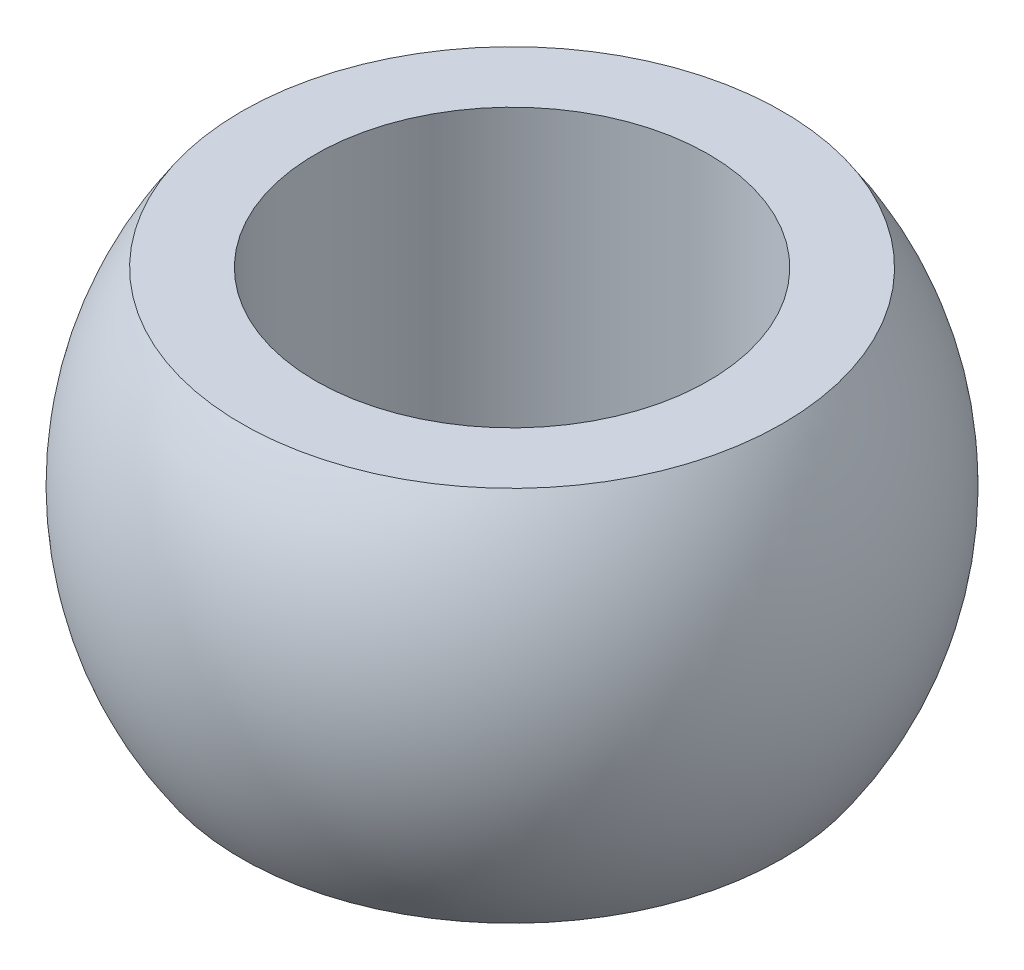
from build123d import *


with BuildPart() as part:
    # Esquisse1 → Base-R_volution (revolve)
    with BuildSketch(Plane.XY):
        with BuildLine():
            Line((-20.105969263, 14), (-14.6, 14))
            Line((-14.6, 14), (-14.6, -14))
            Line((-14.6, -14), (-20.105969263, -14))
            ThreePointArc((-20.105969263, -14), (-24.5, 0), (-20.105969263, 14))
        make_face()
    revolve(axis=Axis((0, 20.701831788, 0), (0, -1, 0)))


solid = part.part
